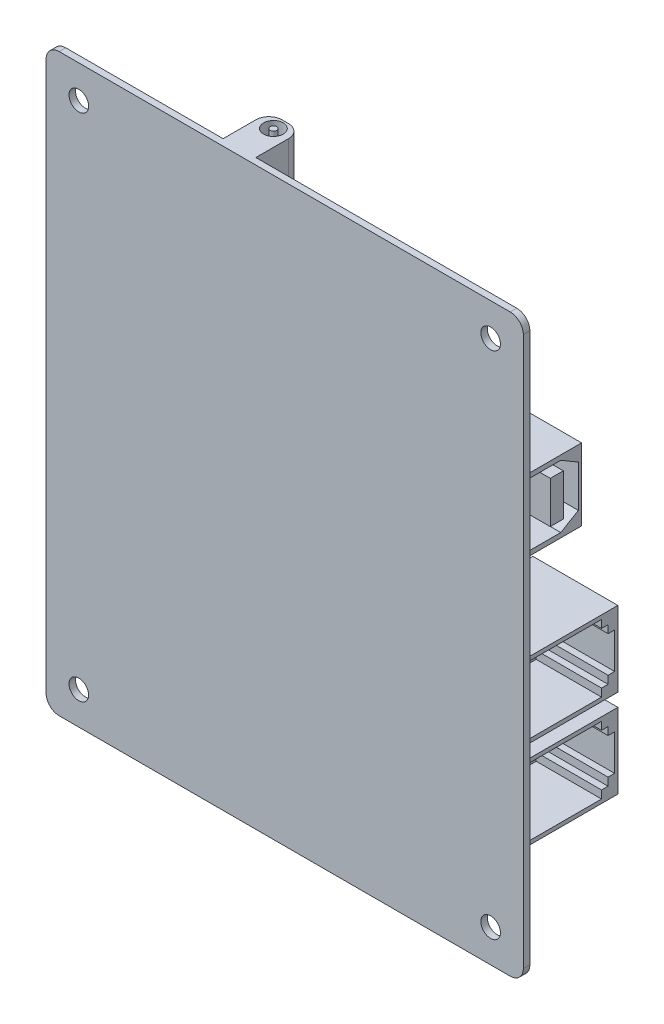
from build123d import *

# Parameters (mm, degrees)
ESQUISSE1_W                       = 4
ESQUISSE1_H                       = 3.3
BOSS_EXTRU_1_DEPTH                = 2
ESQUISSE2_W                       = 4
ESQUISSE2_H                       = 5.132291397
BOSS_EXTRU_2_DEPTH                = 5.328499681
ESQUISSE3_W                       = 5.32849968
ESQUISSE3_H                       = 5.132291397
BOSS_EXTRU_3_DEPTH                = 1
ESQUISSE4_W                       = 5.32849968
ESQUISSE4_H                       = 5
BOSS_EXTRU_4_DEPTH                = 6.867708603
ESQUISSE5_W                       = 73
ESQUISSE5_H                       = 88
BOSS_EXTRU_5_DEPTH                = 1
ESQUISSE6_W                       = 5
ESQUISSE6_H                       = 4
ENL_V_MAT_EXTRU_1_DEPTH           = 3.3
ESQUISSE7_W                       = 14
ESQUISSE7_H                       = 11
BOSS_EXTRU_6_DEPTH                = 10
ESQUISSE8_W                       = 8.701477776
ESQUISSE8_H                       = 9.572454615
ENL_V_MAT_EXTRU_2_DEPTH           = 10
ESQUISSE9_W                       = 2
ESQUISSE9_H                       = 6.398357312
BOSS_EXTRU_7_DEPTH                = 10
ESQUISSE10_W                      = 5.8
ESQUISSE10_H                      = 5.8
BOSS_EXTRU_8_DEPTH                = 2
ESQUISSE11_W                      = 13
ESQUISSE11_H                      = 11.5
BOSS_EXTRU_9_DEPTH                = 14
ENL_V_MAT_EXTRU_3_DEPTH           = 10
ESQUISSE13_W                      = 13
ESQUISSE13_H                      = 11.5
BOSS_EXTRU_10_DEPTH               = 14
ENL_V_MAT_EXTRU_4_DEPTH           = 10
ESQUISSE15_W                      = 13
ESQUISSE15_H                      = 11.5
BOSS_EXTRU_11_DEPTH               = 14
ENL_V_MAT_EXTRU_5_DEPTH           = 10
ESQUISSE17_W                      = 13
ESQUISSE17_H                      = 11.5
BOSS_EXTRU_12_DEPTH               = 14
ENL_V_MAT_EXTRU_6_DEPTH           = 10
ESQUISSE19_W                      = 5
ESQUISSE19_H                      = 12.332239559
BOSS_EXTRU_13_DEPTH               = 7
DIAM_TRE_DU_PER_AGE_3_0_3_1_D     = 3
DIAM_TRE_DU_PER_AGE_3_0_3_1_DEPTH = 8
ESQUISSE22_W                      = 4
ESQUISSE22_H                      = 7
ESQUISSE23_W                      = 0.5
ESQUISSE23_H                      = 8
ESQUISSE24_W                      = 1.5
ESQUISSE24_H                      = 1
DIAM_TRE_DU_PER_AGE_3_0_3_2_D     = 3
DIAM_TRE_DU_PER_AGE_3_0_3_2_DEPTH = 15
DIAM_TRE_DU_PER_AGE_2_0_2_1_D     = 2
DIAM_TRE_DU_PER_AGE_2_0_2_1_DEPTH = 7
CHANFREIN1_SIZE                   = 1.587048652
CHANFREIN1_SIZE2                  = 2.684684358
CHANFREIN2_SIZE                   = 2.684684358
CHANFREIN2_SIZE2                  = 1.587048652
CONG_1_R                          = 2


with BuildPart() as part:
    # Esquisse1 → Boss.-Extru.1 (new body)
    with BuildSketch(Plane(origin=(-0.211361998, 0, 0), x_dir=(0, -1, 0), z_dir=(-1, 0, 0))):
        with Locations((-67.295841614, -2.35)):
            Rectangle(ESQUISSE1_W, ESQUISSE1_H)
    extrude(amount=-BOSS_EXTRU_1_DEPTH)

    # Esquisse2 → Boss.-Extru.2 (add)
    with BuildSketch(Plane(origin=(1.788638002, 0, 0), x_dir=(0, 0, -1), z_dir=(1, 0, 0))):
        with Locations((2, 66.729695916)):
            Rectangle(ESQUISSE2_W, ESQUISSE2_H)
    extrude(amount=BOSS_EXTRU_2_DEPTH)

    # Esquisse3 → Boss.-Extru.3 (add)
    with BuildSketch(Plane(origin=(0, 0, -4), x_dir=(-1, 0, 0), z_dir=(0, 0, -1))):
        with Locations((-4.452887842, 66.729695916)):
            Rectangle(ESQUISSE3_W, ESQUISSE3_H)
    extrude(amount=BOSS_EXTRU_3_DEPTH)

    # Esquisse4 → Boss.-Extru.4 (add)
    with BuildSketch(Plane(origin=(0, 69.295841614, 0), x_dir=(-1, 0, 0), z_dir=(0, 1, 0))):
        with Locations((-4.452887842, -2.5)):
            Rectangle(ESQUISSE4_W, ESQUISSE4_H)
    extrude(amount=BOSS_EXTRU_4_DEPTH)

    # Esquisse5 → Boss.-Extru.5 (add)
    with BuildSketch(Plane(origin=(0, 0, 0), x_dir=(-1, 0, 0), z_dir=(0, 0, -1))):
        with Locations((-36.5, 44)):
            Rectangle(ESQUISSE5_W, ESQUISSE5_H)
    extrude(amount=-BOSS_EXTRU_5_DEPTH)

    # Esquisse6 → Enl_v. mat.-Extru.1 (cut)
    with BuildSketch(Plane.XY.offset(-0.7)):
        with Locations((4.288638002, 71.295841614)):
            Rectangle(ESQUISSE6_W, ESQUISSE6_H)
    extrude(amount=-ENL_V_MAT_EXTRU_1_DEPTH, mode=Mode.SUBTRACT)

    # Esquisse7 → Boss.-Extru.6 (add)
    with BuildSketch(Plane(origin=(0, 0, 0), x_dir=(-1, 0, 0), z_dir=(0, 0, -1))):
        with Locations((-63.915568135, 59.617003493)):
            Rectangle(ESQUISSE7_W, ESQUISSE7_H)
    extrude(amount=BOSS_EXTRU_6_DEPTH)

    # Esquisse8 → Enl_v. mat.-Extru.2 (cut)
    with BuildSketch(Plane(origin=(70.915568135, 0, 0), x_dir=(0, 0, -1), z_dir=(1, 0, 0))):
        with Locations((5.149261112, 59.617003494)):
            Rectangle(ESQUISSE8_W, ESQUISSE8_H)
    extrude(amount=-ENL_V_MAT_EXTRU_2_DEPTH, mode=Mode.SUBTRACT)

    # Esquisse9 → Boss.-Extru.7 (add)
    with BuildSketch(Plane(origin=(60.915568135, 0, 0), x_dir=(0, 0, -1), z_dir=(1, 0, 0))):
        with Locations((6.204681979, 59.617003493)):
            Rectangle(ESQUISSE9_W, ESQUISSE9_H)
    extrude(amount=BOSS_EXTRU_7_DEPTH)

    # Esquisse10 → Boss.-Extru.8 (add)
    with BuildSketch(Plane(origin=(0, 0, 0), x_dir=(-1, 0, 0), z_dir=(0, 0, -1))):
        with Locations((-18.480480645, 6.636303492)):
            Rectangle(ESQUISSE10_W, ESQUISSE10_H)
    extrude(amount=BOSS_EXTRU_8_DEPTH)

    # Esquisse11 → Boss.-Extru.9 (add)
    with BuildSketch(Plane(origin=(0, 0, 0), x_dir=(-1, 0, 0), z_dir=(0, 0, -1))):
        with Locations((-65.965950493, 36.608065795)):
            Rectangle(ESQUISSE11_W, ESQUISSE11_H)
    extrude(amount=BOSS_EXTRU_9_DEPTH)

    # Esquisse12 → Enl_v. mat.-Extru.3 (cut)
    with BuildSketch(Plane(origin=(72.465950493, 0, 0), x_dir=(0, 0, -1), z_dir=(1, 0, 0))):
        Polygon((13.5, 39.358065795), (12.5, 39.358065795), (12.5, 40.558065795), (11.5, 40.558065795), (11.5, 41.758065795), (0.5, 41.758065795), (0.5, 31.458065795), (11.5, 31.458065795), (11.5, 32.658065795), (12.5, 32.658065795), (12.5, 33.858065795), (13.5, 33.858065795), align=None)
    extrude(amount=-ENL_V_MAT_EXTRU_3_DEPTH, mode=Mode.SUBTRACT)

    # Esquisse13 → Boss.-Extru.10 (add)
    with BuildSketch(Plane(origin=(0, 0, 0), x_dir=(-1, 0, 0), z_dir=(0, 0, -1))):
        with Locations((-65.965950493, 23.108065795)):
            Rectangle(ESQUISSE13_W, ESQUISSE13_H)
    extrude(amount=BOSS_EXTRU_10_DEPTH)

    # Esquisse14 → Enl_v. mat.-Extru.4 (cut)
    with BuildSketch(Plane(origin=(72.465950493, 0, 0), x_dir=(0, 0, -1), z_dir=(1, 0, 0))):
        Polygon((13.5, 25.858065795), (12.5, 25.858065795), (12.5, 27.058065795), (11.5, 27.058065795), (11.5, 28.258065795), (0.5, 28.258065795), (0.5, 17.958065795), (11.5, 17.958065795), (11.5, 19.158065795), (12.5, 19.158065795), (12.5, 20.358065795), (13.5, 20.358065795), align=None)
    extrude(amount=-ENL_V_MAT_EXTRU_4_DEPTH, mode=Mode.SUBTRACT)

    # Esquisse15 → Boss.-Extru.11 (add)
    with BuildSketch(Plane(origin=(0, 0, 0), x_dir=(-1, 0, 0), z_dir=(0, 0, -1))):
        with Locations((-8.316688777, 36.608065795)):
            Rectangle(ESQUISSE15_W, ESQUISSE15_H)
    extrude(amount=BOSS_EXTRU_11_DEPTH)

    # Esquisse16 → Enl_v. mat.-Extru.5 (cut)
    with BuildSketch(Plane.ZY.offset(-1.816688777)):
        Polygon((-11.5, 40.558065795), (-12.5, 40.558065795), (-12.5, 39.358065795), (-13.5, 39.358065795), (-13.5, 33.858065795), (-12.5, 33.858065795), (-12.5, 32.658065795), (-11.5, 32.658065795), (-11.5, 31.458065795), (-0.5, 31.458065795), (-0.5, 41.758065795), (-11.5, 41.758065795), align=None)
    extrude(amount=-ENL_V_MAT_EXTRU_5_DEPTH, mode=Mode.SUBTRACT)

    # Esquisse17 → Boss.-Extru.12 (add)
    with BuildSketch(Plane(origin=(0, 0, 0), x_dir=(-1, 0, 0), z_dir=(0, 0, -1))):
        with Locations((-8.316688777, 23.108065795)):
            Rectangle(ESQUISSE17_W, ESQUISSE17_H)
    extrude(amount=BOSS_EXTRU_12_DEPTH)

    # Esquisse18 → Enl_v. mat.-Extru.6 (cut)
    with BuildSketch(Plane.ZY.offset(-1.816688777)):
        Polygon((-13.5, 20.358065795), (-12.5, 20.358065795), (-12.5, 19.158065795), (-11.5, 19.158065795), (-11.5, 17.958065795), (-0.5, 17.958065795), (-0.5, 28.258065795), (-11.5, 28.258065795), (-11.5, 27.058065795), (-12.5, 27.058065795), (-12.5, 25.858065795), (-13.5, 25.858065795), align=None)
    extrude(amount=-ENL_V_MAT_EXTRU_6_DEPTH, mode=Mode.SUBTRACT)

    # Esquisse19 → Boss.-Extru.13 (add)
    with BuildSketch(Plane(origin=(0, 0, 0), x_dir=(-1, 0, 0), z_dir=(0, 0, -1))):
        with Locations((-28.576914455, 81.83388022)):
            Rectangle(ESQUISSE19_W, ESQUISSE19_H)
    extrude(amount=BOSS_EXTRU_13_DEPTH)

    # Diam_tre du per_age _3.0 _3_1
    with Locations(Plane(origin=(0, 88, 0), x_dir=(1, 0, 0), z_dir=(0, 1, 0))):
        with Locations((28.576914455, 5.195450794)):
            Hole(DIAM_TRE_DU_PER_AGE_3_0_3_1_D / 2, depth=DIAM_TRE_DU_PER_AGE_3_0_3_1_DEPTH)

    # Esquisse22 → R_volution1 (revolve)
    with BuildSketch(Plane(origin=(0, 6.619073, 0), x_dir=(1, 0, 0), z_dir=(0, 1, 0))):
        with Locations((59.345009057, 3.5)):
            Rectangle(ESQUISSE22_W, ESQUISSE22_H)
    revolve(axis=Axis((57.345009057, 6.619073, -7), (0, 0, 1)))

    # Esquisse23 → R_volution2 (revolve)
    with BuildSketch(Plane(origin=(0, 0, -5.195450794), x_dir=(-1, 0, 0), z_dir=(0, 0, -1)), mode=Mode.PRIVATE) as r_volution2_sk:
        with Locations((-28.826914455, 84)):
            Rectangle(ESQUISSE23_W, ESQUISSE23_H)
    revolve(r_volution2_sk.sketch.rotate(Axis((28.576914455, 80, -5.195450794), (0, 1, 0)), 270), axis=Axis((28.576914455, 80, -5.195450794), (0, 1, 0)))

    # Esquisse24 → R_volution3 (revolve)
    with BuildSketch(Plane(origin=(0, 6.71336295, 0), x_dir=(1, 0, 0), z_dir=(0, 1, 0))):
        with Locations((19.180480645, 2.5)):
            Rectangle(ESQUISSE24_W, ESQUISSE24_H)
    revolve(axis=Axis((18.430480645, 6.71336295, -3), (0, 0, 1)))

    # Diam_tre du per_age _3.0 _3_2
    with Locations(Plane.XY.offset(1)):
        with Locations((68, 5), (5, 83), (5, 5), (68, 83)):
            Hole(DIAM_TRE_DU_PER_AGE_3_0_3_2_D / 2, depth=DIAM_TRE_DU_PER_AGE_3_0_3_2_DEPTH)

    # Diam_tre du per_age _2.0 _2_1
    with Locations(Plane(origin=(0, 0, -7), x_dir=(-1, 0, 0), z_dir=(0, 0, -1))):
        with Locations((-57.345009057, 6.619073)):
            Hole(DIAM_TRE_DU_PER_AGE_2_0_2_1_D / 2, depth=DIAM_TRE_DU_PER_AGE_2_0_2_1_DEPTH)

    # Chanfrein1
    chanfrein1_edges = [part.edges().sort_by_distance(p)[0] for p in [
        (65.915568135, 54.830776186, -9.5),
    ]]
    chanfrein1_side = [part.faces().sort_by_distance(p)[0] for p in [
        (65.915568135, 59.617003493, -9.5),
    ]]
    chamfer(chanfrein1_edges, length=CHANFREIN1_SIZE, length2=CHANFREIN1_SIZE2, reference=chanfrein1_side[0])

    # Chanfrein2
    chanfrein2_edges = [part.edges().sort_by_distance(p)[0] for p in [
        (65.915568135, 64.403230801, -9.5),
    ]]
    chanfrein2_side = [part.faces().sort_by_distance(p)[0] for p in [
        (65.915568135, 64.403230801, -5.149261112),
    ]]
    chamfer(chanfrein2_edges, length=CHANFREIN2_SIZE, length2=CHANFREIN2_SIZE2, reference=chanfrein2_side[0])

    # Cong_1
    cong_1_edges = [part.edges().sort_by_distance(p)[0] for p in [
        (26.076914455, 81.83388022, -7),
        (31.076914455, 81.83388022, -7),
        (0, 88, 0.5),
        (0, 0, 0.5),
        (73, 0, 0.5),
        (73, 88, 0.5),
    ]]
    fillet(cong_1_edges, radius=CONG_1_R)


solid = part.part
